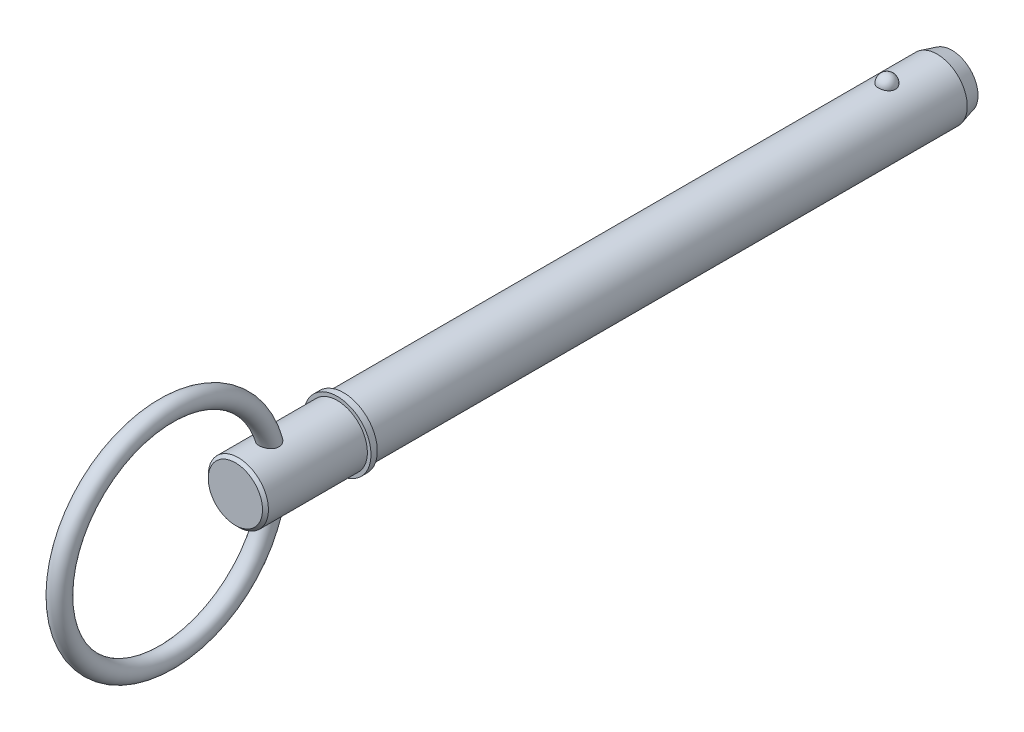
from build123d import *

# Parameters (mm, degrees)
SKETCH2_R           = 7.145
BOSS_EXTRUDE1_DEPTH = 127
BOSS_EXTRUDE2_START = 17.45
SKETCH3_R           = 7.145
BOSS_EXTRUDE2_DEPTH = 17.45
CHAMFER1_SIZE       = 3.5
CHAMFER1_SIZE2      = 0.937822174
SKETCH20_W          = 1.5
SKETCH20_H          = 8
SKETCH21_R          = 7.145
BOSS_EXTRUDE3_DEPTH = 25.7
CHAMFER2_SIZE       = 0.7
SKETCH24_R          = 2.25


with BuildPart() as part:
    # Sketch2 → Boss-Extrude1 (new body)
    with BuildSketch(Plane.XY):
        Circle(SKETCH2_R)
    extrude(amount=BOSS_EXTRUDE1_DEPTH)

    # Sketch3 → Boss-Extrude2 (add)
    with BuildSketch(Plane(origin=(0, 0, 0), x_dir=(-1, 0, 0), z_dir=(0, 0, -1)).offset(BOSS_EXTRUDE2_START)):
        Circle(SKETCH3_R)
    extrude(amount=-BOSS_EXTRUDE2_DEPTH)

    # Chamfer1
    chamfer1_edges = [part.edges().sort_by_distance(p)[0] for p in [
        (7.145, 0, -17.45),
    ]]
    chamfer1_side = [part.faces().sort_by_distance(p)[0] for p in [
        (7.145, 0, -8.725),
    ]]
    chamfer(chamfer1_edges, length=CHAMFER1_SIZE, length2=CHAMFER1_SIZE2, reference=chamfer1_side[0])

    # Sketch18 → Revolve1 (revolve)
    with BuildSketch(Plane(origin=(0, 0, 0), x_dir=(0, 0, -1), z_dir=(1, 0, 0))):
        with BuildLine():
            Line((2.02, 9.165), (2.02, 5.125))
            ThreePointArc((2.02, 5.125), (0, 7.145), (2.02, 9.165))
        make_face()
    revolve(axis=Axis((0, 9.165, -2.02), (0, -1, 0)))

    # Sketch20 → Revolve2 (revolve)
    with BuildSketch(Plane(origin=(0, 0, 0), x_dir=(0, 0, -1), z_dir=(1, 0, 0)), mode=Mode.PRIVATE) as revolve2_sk:
        with Locations((-127.75, 4)):
            Rectangle(SKETCH20_W, SKETCH20_H)
    revolve(revolve2_sk.sketch.rotate(Axis((0, 0, 33.728787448), (0, 0, 1)), 90), axis=Axis((0, 0, 33.728787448), (0, 0, 1)))

    # Sketch21 → Boss-Extrude3 (add)
    with BuildSketch(Plane(origin=(0, 0, 127), x_dir=(-1, 0, 0), z_dir=(0, 0, -1))):
        Circle(SKETCH21_R)
    extrude(amount=-BOSS_EXTRUDE3_DEPTH)

    # Chamfer2
    chamfer2_edges = [part.edges().sort_by_distance(p)[0] for p in [
        (7.145, 0, 152.7),
    ]]
    chamfer(chamfer2_edges, length=CHAMFER2_SIZE)

    # Sweep1: sweep along a path in Sketch23
    with BuildLine(Plane(origin=(0, 0, 0), x_dir=(0, 0, -1), z_dir=(1, 0, 0))) as sweep1_path:
        CenterArc((-169.1, 0), 25.4, 0, 360)
    # Sketch24 → Sweep1 (sweep)
    with BuildSketch(Plane(origin=(0, 0, 0), x_dir=(1, 0, 0), z_dir=(0, 1, 0))):
        with Locations((0, -143.7)):
            Circle(SKETCH24_R)
    sweep(path=sweep1_path.line)


solid = part.part
